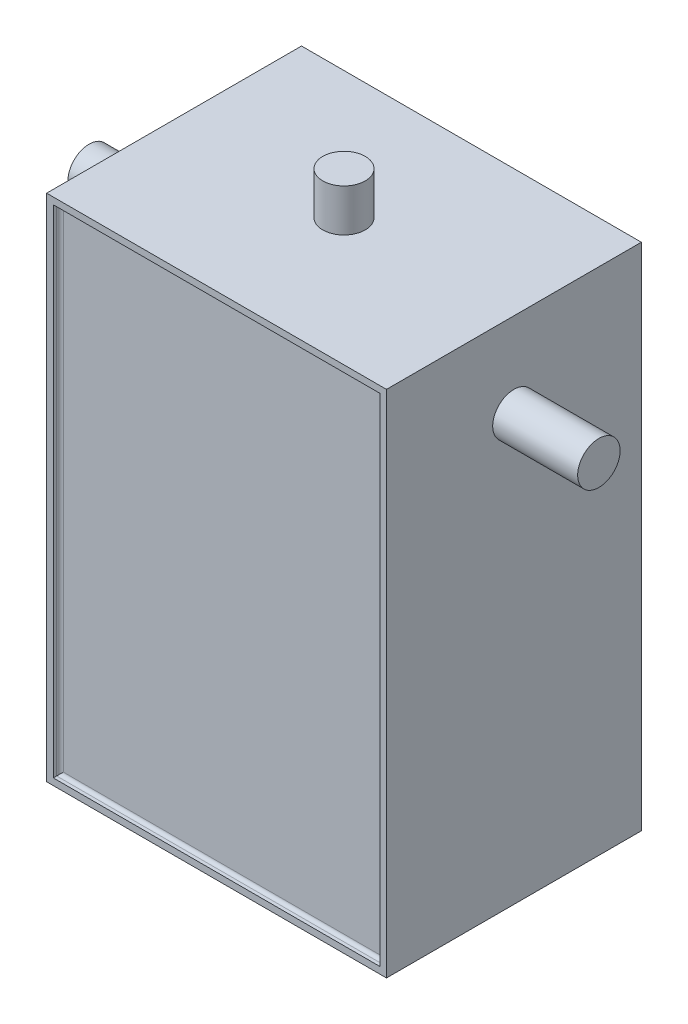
ISO-10303-21;
HEADER;
FILE_DESCRIPTION(('STEP AP214'),'2;1');
FILE_NAME('part.step','',(''),(''),'','','');
FILE_SCHEMA(('AUTOMOTIVE_DESIGN { 1 0 10303 214 1 1 1 1 }'));
ENDSEC;
DATA;
#1=APPLICATION_CONTEXT('core data for automotive mechanical design processes');
#2=APPLICATION_PROTOCOL_DEFINITION('international standard','automotive_design',2000,#1);
#3=PRODUCT_CONTEXT('',#1,'mechanical');
#4=PRODUCT('Part','Part','',(#3));
#5=PRODUCT_RELATED_PRODUCT_CATEGORY('part','',(#4));
#6=PRODUCT_DEFINITION_FORMATION('','',#4);
#7=PRODUCT_DEFINITION_CONTEXT('part definition',#1,'design');
#8=PRODUCT_DEFINITION('design','',#6,#7);
#9=PRODUCT_DEFINITION_SHAPE('','',#8);
#10=(LENGTH_UNIT() NAMED_UNIT(*) SI_UNIT(.MILLI.,.METRE.));
#11=(NAMED_UNIT(*) PLANE_ANGLE_UNIT() SI_UNIT($,.RADIAN.));
#12=(NAMED_UNIT(*) SI_UNIT($,.STERADIAN.) SOLID_ANGLE_UNIT());
#13=UNCERTAINTY_MEASURE_WITH_UNIT(LENGTH_MEASURE(1.E-05),#10,'distance_accuracy_value','');
#14=(GEOMETRIC_REPRESENTATION_CONTEXT(3) GLOBAL_UNCERTAINTY_ASSIGNED_CONTEXT((#13)) GLOBAL_UNIT_ASSIGNED_CONTEXT((#10,
#11,#12)) REPRESENTATION_CONTEXT('',''));
#15=CARTESIAN_POINT('',(0.,0.,0.));
#16=DIRECTION('',(0.,0.,1.));
#17=DIRECTION('',(1.,0.,0.));
#18=AXIS2_PLACEMENT_3D('',#15,#16,#17);
#19=CARTESIAN_POINT('',(0.,0.,-76.2));
#20=DIRECTION('',(0.,0.,-1.));
#21=DIRECTION('',(-1.,0.,0.));
#22=AXIS2_PLACEMENT_3D('',#19,#20,#21);
#23=PLANE('',#22);
#24=DIRECTION('',(0.,-1.,0.));
#25=VECTOR('',#24,1.);
#26=CARTESIAN_POINT('',(0.,0.,-76.2));
#27=LINE('',#26,#25);
#28=CARTESIAN_POINT('',(0.,152.4,-76.2));
#29=VERTEX_POINT('',#28);
#30=CARTESIAN_POINT('',(0.,0.,-76.2));
#31=VERTEX_POINT('',#30);
#32=EDGE_CURVE('E227',#29,#31,#27,.T.);
#33=ORIENTED_EDGE('',*,*,#32,.F.);
#34=DIRECTION('',(-1.,0.,0.));
#35=VECTOR('',#34,1.);
#36=CARTESIAN_POINT('',(0.,152.4,-76.2));
#37=LINE('',#36,#35);
#38=CARTESIAN_POINT('',(101.6,152.4,-76.2));
#39=VERTEX_POINT('',#38);
#40=EDGE_CURVE('E237',#39,#29,#37,.T.);
#41=ORIENTED_EDGE('',*,*,#40,.F.);
#42=DIRECTION('',(0.,1.,0.));
#43=VECTOR('',#42,1.);
#44=CARTESIAN_POINT('',(101.6,0.,-76.2));
#45=LINE('',#44,#43);
#46=CARTESIAN_POINT('',(101.6,0.,-76.2));
#47=VERTEX_POINT('',#46);
#48=EDGE_CURVE('E234',#47,#39,#45,.T.);
#49=ORIENTED_EDGE('',*,*,#48,.F.);
#50=DIRECTION('',(1.,0.,0.));
#51=VECTOR('',#50,1.);
#52=CARTESIAN_POINT('',(0.,0.,-76.2));
#53=LINE('',#52,#51);
#54=EDGE_CURVE('E230',#31,#47,#53,.T.);
#55=ORIENTED_EDGE('',*,*,#54,.F.);
#56=EDGE_LOOP('',(#33,#41,#49,#55));
#57=FACE_BOUND('',#56,.T.);
#58=DIRECTION('',(0.,1.,0.));
#59=VECTOR('',#58,1.);
#60=CARTESIAN_POINT('',(99.6,2.,-76.2));
#61=LINE('',#60,#59);
#62=CARTESIAN_POINT('',(99.6,2.,-76.2));
#63=VERTEX_POINT('',#62);
#64=CARTESIAN_POINT('',(99.6,150.4,-76.2));
#65=VERTEX_POINT('',#64);
#66=EDGE_CURVE('E167',#63,#65,#61,.T.);
#67=ORIENTED_EDGE('',*,*,#66,.T.);
#68=DIRECTION('',(-1.,0.,0.));
#69=VECTOR('',#68,1.);
#70=CARTESIAN_POINT('',(99.6,150.4,-76.2));
#71=LINE('',#70,#69);
#72=CARTESIAN_POINT('',(2.,150.4,-76.2));
#73=VERTEX_POINT('',#72);
#74=EDGE_CURVE('E172',#65,#73,#71,.T.);
#75=ORIENTED_EDGE('',*,*,#74,.T.);
#76=DIRECTION('',(0.,-1.,0.));
#77=VECTOR('',#76,1.);
#78=CARTESIAN_POINT('',(2.,150.4,-76.2));
#79=LINE('',#78,#77);
#80=CARTESIAN_POINT('',(2.,2.,-76.2));
#81=VERTEX_POINT('',#80);
#82=EDGE_CURVE('E175',#73,#81,#79,.T.);
#83=ORIENTED_EDGE('',*,*,#82,.T.);
#84=DIRECTION('',(1.,0.,0.));
#85=VECTOR('',#84,1.);
#86=CARTESIAN_POINT('',(2.,2.,-76.2));
#87=LINE('',#86,#85);
#88=EDGE_CURVE('E159',#81,#63,#87,.T.);
#89=ORIENTED_EDGE('',*,*,#88,.T.);
#90=EDGE_LOOP('',(#67,#75,#83,#89));
#91=FACE_BOUND('',#90,.T.);
#92=ADVANCED_FACE('F41',(#57,#91),#23,.T.);
#93=CARTESIAN_POINT('',(0.,0.,-76.2));
#94=DIRECTION('',(-1.,0.,0.));
#95=DIRECTION('',(0.,0.,1.));
#96=AXIS2_PLACEMENT_3D('',#93,#94,#95);
#97=PLANE('',#96);
#98=CARTESIAN_POINT('',(0.,127.,-38.1));
#99=DIRECTION('',(1.,0.,0.));
#100=DIRECTION('',(0.,1.,0.));
#101=AXIS2_PLACEMENT_3D('',#98,#99,#100);
#102=CIRCLE('',#101,6.35);
#103=CARTESIAN_POINT('',(0.,133.35,-38.1));
#104=VERTEX_POINT('',#103);
#105=EDGE_CURVE('E215',#104,#104,#102,.T.);
#106=ORIENTED_EDGE('',*,*,#105,.T.);
#107=EDGE_LOOP('',(#106));
#108=FACE_BOUND('',#107,.T.);
#109=DIRECTION('',(0.,-1.,0.));
#110=VECTOR('',#109,1.);
#111=CARTESIAN_POINT('',(0.,0.,0.));
#112=LINE('',#111,#110);
#113=CARTESIAN_POINT('',(0.,152.4,0.));
#114=VERTEX_POINT('',#113);
#115=CARTESIAN_POINT('',(0.,0.,0.));
#116=VERTEX_POINT('',#115);
#117=EDGE_CURVE('E224',#114,#116,#112,.T.);
#118=ORIENTED_EDGE('',*,*,#117,.F.);
#119=DIRECTION('',(0.,0.,1.));
#120=VECTOR('',#119,1.);
#121=CARTESIAN_POINT('',(0.,152.4,-76.2));
#122=LINE('',#121,#120);
#123=EDGE_CURVE('E214',#29,#114,#122,.T.);
#124=ORIENTED_EDGE('',*,*,#123,.F.);
#125=ORIENTED_EDGE('',*,*,#32,.T.);
#126=DIRECTION('',(0.,0.,1.));
#127=VECTOR('',#126,1.);
#128=CARTESIAN_POINT('',(0.,0.,-76.2));
#129=LINE('',#128,#127);
#130=EDGE_CURVE('E240',#31,#116,#129,.T.);
#131=ORIENTED_EDGE('',*,*,#130,.T.);
#132=EDGE_LOOP('',(#118,#124,#125,#131));
#133=FACE_BOUND('',#132,.T.);
#134=ADVANCED_FACE('F329',(#108,#133),#97,.T.);
#135=CARTESIAN_POINT('',(0.,152.4,-76.2));
#136=DIRECTION('',(0.,1.,0.));
#137=DIRECTION('',(0.,0.,1.));
#138=AXIS2_PLACEMENT_3D('',#135,#136,#137);
#139=PLANE('',#138);
#140=CARTESIAN_POINT('',(50.8,152.4,-38.1));
#141=DIRECTION('',(0.,1.,0.));
#142=DIRECTION('',(0.,0.,1.));
#143=AXIS2_PLACEMENT_3D('',#140,#141,#142);
#144=CIRCLE('',#143,6.35);
#145=CARTESIAN_POINT('',(50.8,152.4,-31.75));
#146=VERTEX_POINT('',#145);
#147=EDGE_CURVE('E310',#146,#146,#144,.T.);
#148=ORIENTED_EDGE('',*,*,#147,.F.);
#149=EDGE_LOOP('',(#148));
#150=FACE_BOUND('',#149,.T.);
#151=DIRECTION('',(-1.,0.,0.));
#152=VECTOR('',#151,1.);
#153=CARTESIAN_POINT('',(0.,152.4,0.));
#154=LINE('',#153,#152);
#155=CARTESIAN_POINT('',(101.6,152.4,0.));
#156=VERTEX_POINT('',#155);
#157=EDGE_CURVE('E231',#156,#114,#154,.T.);
#158=ORIENTED_EDGE('',*,*,#157,.F.);
#159=DIRECTION('',(0.,0.,1.));
#160=VECTOR('',#159,1.);
#161=CARTESIAN_POINT('',(101.6,152.4,-76.2));
#162=LINE('',#161,#160);
#163=EDGE_CURVE('E252',#39,#156,#162,.T.);
#164=ORIENTED_EDGE('',*,*,#163,.F.);
#165=ORIENTED_EDGE('',*,*,#40,.T.);
#166=ORIENTED_EDGE('',*,*,#123,.T.);
#167=EDGE_LOOP('',(#158,#164,#165,#166));
#168=FACE_BOUND('',#167,.T.);
#169=ADVANCED_FACE('F325',(#150,#168),#139,.T.);
#170=CARTESIAN_POINT('',(101.6,0.,-76.2));
#171=DIRECTION('',(1.,0.,0.));
#172=DIRECTION('',(0.,1.,0.));
#173=AXIS2_PLACEMENT_3D('',#170,#171,#172);
#174=PLANE('',#173);
#175=CARTESIAN_POINT('',(101.6,127.,-38.1));
#176=DIRECTION('',(1.,0.,0.));
#177=DIRECTION('',(0.,1.,0.));
#178=AXIS2_PLACEMENT_3D('',#175,#176,#177);
#179=CIRCLE('',#178,6.35);
#180=CARTESIAN_POINT('',(101.6,133.35,-38.1));
#181=VERTEX_POINT('',#180);
#182=EDGE_CURVE('E218',#181,#181,#179,.T.);
#183=ORIENTED_EDGE('',*,*,#182,.F.);
#184=EDGE_LOOP('',(#183));
#185=FACE_BOUND('',#184,.T.);
#186=DIRECTION('',(0.,1.,0.));
#187=VECTOR('',#186,1.);
#188=CARTESIAN_POINT('',(101.6,0.,0.));
#189=LINE('',#188,#187);
#190=CARTESIAN_POINT('',(101.6,0.,0.));
#191=VERTEX_POINT('',#190);
#192=EDGE_CURVE('E246',#191,#156,#189,.T.);
#193=ORIENTED_EDGE('',*,*,#192,.F.);
#194=DIRECTION('',(0.,0.,1.));
#195=VECTOR('',#194,1.);
#196=CARTESIAN_POINT('',(101.6,0.,-76.2));
#197=LINE('',#196,#195);
#198=EDGE_CURVE('E254',#47,#191,#197,.T.);
#199=ORIENTED_EDGE('',*,*,#198,.F.);
#200=ORIENTED_EDGE('',*,*,#48,.T.);
#201=ORIENTED_EDGE('',*,*,#163,.T.);
#202=EDGE_LOOP('',(#193,#199,#200,#201));
#203=FACE_BOUND('',#202,.T.);
#204=ADVANCED_FACE('F328',(#185,#203),#174,.T.);
#205=CARTESIAN_POINT('',(0.,0.,-76.2));
#206=DIRECTION('',(0.,-1.,0.));
#207=DIRECTION('',(0.,0.,-1.));
#208=AXIS2_PLACEMENT_3D('',#205,#206,#207);
#209=PLANE('',#208);
#210=CARTESIAN_POINT('',(50.8,0.,-38.1));
#211=DIRECTION('',(0.,-1.,0.));
#212=DIRECTION('',(0.,0.,-1.));
#213=AXIS2_PLACEMENT_3D('',#210,#211,#212);
#214=CIRCLE('',#213,12.7);
#215=CARTESIAN_POINT('',(50.8,0.,-50.8));
#216=VERTEX_POINT('',#215);
#217=EDGE_CURVE('E210',#216,#216,#214,.T.);
#218=ORIENTED_EDGE('',*,*,#217,.F.);
#219=EDGE_LOOP('',(#218));
#220=FACE_BOUND('',#219,.T.);
#221=DIRECTION('',(1.,0.,0.));
#222=VECTOR('',#221,1.);
#223=CARTESIAN_POINT('',(0.,0.,0.));
#224=LINE('',#223,#222);
#225=EDGE_CURVE('E243',#116,#191,#224,.T.);
#226=ORIENTED_EDGE('',*,*,#225,.F.);
#227=ORIENTED_EDGE('',*,*,#130,.F.);
#228=ORIENTED_EDGE('',*,*,#54,.T.);
#229=ORIENTED_EDGE('',*,*,#198,.T.);
#230=EDGE_LOOP('',(#226,#227,#228,#229));
#231=FACE_BOUND('',#230,.T.);
#232=ADVANCED_FACE('F345',(#220,#231),#209,.T.);
#233=CARTESIAN_POINT('',(0.,0.,0.));
#234=DIRECTION('',(0.,0.,-1.));
#235=DIRECTION('',(-1.,0.,0.));
#236=AXIS2_PLACEMENT_3D('',#233,#234,#235);
#237=PLANE('',#236);
#238=DIRECTION('',(0.,-1.,0.));
#239=VECTOR('',#238,1.);
#240=CARTESIAN_POINT('',(2.,150.4,0.));
#241=LINE('',#240,#239);
#242=CARTESIAN_POINT('',(2.,150.4,0.));
#243=VERTEX_POINT('',#242);
#244=CARTESIAN_POINT('',(2.,2.,0.));
#245=VERTEX_POINT('',#244);
#246=EDGE_CURVE('E188',#243,#245,#241,.T.);
#247=ORIENTED_EDGE('',*,*,#246,.F.);
#248=DIRECTION('',(-1.,0.,0.));
#249=VECTOR('',#248,1.);
#250=CARTESIAN_POINT('',(99.6,150.4,0.));
#251=LINE('',#250,#249);
#252=CARTESIAN_POINT('',(99.6,150.4,0.));
#253=VERTEX_POINT('',#252);
#254=EDGE_CURVE('E185',#253,#243,#251,.T.);
#255=ORIENTED_EDGE('',*,*,#254,.F.);
#256=DIRECTION('',(0.,1.,0.));
#257=VECTOR('',#256,1.);
#258=CARTESIAN_POINT('',(99.6,2.,0.));
#259=LINE('',#258,#257);
#260=CARTESIAN_POINT('',(99.6,2.,0.));
#261=VERTEX_POINT('',#260);
#262=EDGE_CURVE('E195',#261,#253,#259,.T.);
#263=ORIENTED_EDGE('',*,*,#262,.F.);
#264=DIRECTION('',(1.,0.,0.));
#265=VECTOR('',#264,1.);
#266=CARTESIAN_POINT('',(2.,2.,0.));
#267=LINE('',#266,#265);
#268=EDGE_CURVE('E192',#245,#261,#267,.T.);
#269=ORIENTED_EDGE('',*,*,#268,.F.);
#270=EDGE_LOOP('',(#247,#255,#263,#269));
#271=FACE_BOUND('',#270,.T.);
#272=ORIENTED_EDGE('',*,*,#117,.T.);
#273=ORIENTED_EDGE('',*,*,#225,.T.);
#274=ORIENTED_EDGE('',*,*,#192,.T.);
#275=ORIENTED_EDGE('',*,*,#157,.T.);
#276=EDGE_LOOP('',(#272,#273,#274,#275));
#277=FACE_BOUND('',#276,.T.);
#278=ADVANCED_FACE('F334',(#271,#277),#237,.F.);
#279=CARTESIAN_POINT('',(127.,127.,-38.1));
#280=DIRECTION('',(-1.,0.,0.));
#281=DIRECTION('',(0.,-1.,0.));
#282=AXIS2_PLACEMENT_3D('',#279,#280,#281);
#283=CYLINDRICAL_SURFACE('',#282,6.35);
#284=CARTESIAN_POINT('',(127.,127.,-38.1));
#285=DIRECTION('',(1.,0.,0.));
#286=DIRECTION('',(0.,1.,0.));
#287=AXIS2_PLACEMENT_3D('',#284,#285,#286);
#288=CIRCLE('',#287,6.35);
#289=CARTESIAN_POINT('',(127.,133.35,-38.1));
#290=VERTEX_POINT('',#289);
#291=EDGE_CURVE('E221',#290,#290,#288,.T.);
#292=ORIENTED_EDGE('',*,*,#291,.F.);
#293=EDGE_LOOP('',(#292));
#294=FACE_BOUND('',#293,.T.);
#295=ORIENTED_EDGE('',*,*,#182,.T.);
#296=EDGE_LOOP('',(#295));
#297=FACE_BOUND('',#296,.T.);
#298=ADVANCED_FACE('F353',(#294,#297),#283,.T.);
#299=CARTESIAN_POINT('',(127.,127.,-38.1));
#300=DIRECTION('',(1.,0.,0.));
#301=DIRECTION('',(0.,1.,0.));
#302=AXIS2_PLACEMENT_3D('',#299,#300,#301);
#303=PLANE('',#302);
#304=ORIENTED_EDGE('',*,*,#291,.T.);
#305=EDGE_LOOP('',(#304));
#306=FACE_BOUND('',#305,.T.);
#307=ADVANCED_FACE('F369',(#306),#303,.T.);
#308=CARTESIAN_POINT('',(0.,127.,-38.1));
#309=DIRECTION('',(-1.,0.,0.));
#310=DIRECTION('',(0.,-1.,0.));
#311=AXIS2_PLACEMENT_3D('',#308,#309,#310);
#312=CYLINDRICAL_SURFACE('',#311,6.35);
#313=ORIENTED_EDGE('',*,*,#105,.F.);
#314=EDGE_LOOP('',(#313));
#315=FACE_BOUND('',#314,.T.);
#316=CARTESIAN_POINT('',(-25.4,127.,-38.1));
#317=DIRECTION('',(1.,0.,0.));
#318=DIRECTION('',(0.,1.,0.));
#319=AXIS2_PLACEMENT_3D('',#316,#317,#318);
#320=CIRCLE('',#319,6.35);
#321=CARTESIAN_POINT('',(-25.4,133.35,-38.1));
#322=VERTEX_POINT('',#321);
#323=EDGE_CURVE('E209',#322,#322,#320,.T.);
#324=ORIENTED_EDGE('',*,*,#323,.T.);
#325=EDGE_LOOP('',(#324));
#326=FACE_BOUND('',#325,.T.);
#327=ADVANCED_FACE('F373',(#315,#326),#312,.T.);
#328=CARTESIAN_POINT('',(-25.4,127.,-38.1));
#329=DIRECTION('',(1.,0.,0.));
#330=DIRECTION('',(0.,1.,0.));
#331=AXIS2_PLACEMENT_3D('',#328,#329,#330);
#332=PLANE('',#331);
#333=ORIENTED_EDGE('',*,*,#323,.F.);
#334=EDGE_LOOP('',(#333));
#335=FACE_BOUND('',#334,.T.);
#336=ADVANCED_FACE('F377',(#335),#332,.F.);
#337=CARTESIAN_POINT('',(50.8,-12.7,-38.1));
#338=DIRECTION('',(0.,1.,0.));
#339=DIRECTION('',(0.,0.,1.));
#340=AXIS2_PLACEMENT_3D('',#337,#338,#339);
#341=CYLINDRICAL_SURFACE('',#340,12.7);
#342=CARTESIAN_POINT('',(50.8,-12.7,-38.1));
#343=DIRECTION('',(0.,-1.,0.));
#344=DIRECTION('',(0.,0.,-1.));
#345=AXIS2_PLACEMENT_3D('',#342,#343,#344);
#346=CIRCLE('',#345,12.7);
#347=CARTESIAN_POINT('',(50.8,-12.7,-50.8));
#348=VERTEX_POINT('',#347);
#349=EDGE_CURVE('E201',#348,#348,#346,.T.);
#350=ORIENTED_EDGE('',*,*,#349,.F.);
#351=EDGE_LOOP('',(#350));
#352=FACE_BOUND('',#351,.T.);
#353=ORIENTED_EDGE('',*,*,#217,.T.);
#354=EDGE_LOOP('',(#353));
#355=FACE_BOUND('',#354,.T.);
#356=ADVANCED_FACE('F381',(#352,#355),#341,.T.);
#357=CARTESIAN_POINT('',(50.8,-12.7,-38.1));
#358=DIRECTION('',(0.,-1.,0.));
#359=DIRECTION('',(0.,0.,-1.));
#360=AXIS2_PLACEMENT_3D('',#357,#358,#359);
#361=PLANE('',#360);
#362=ORIENTED_EDGE('',*,*,#349,.T.);
#363=EDGE_LOOP('',(#362));
#364=FACE_BOUND('',#363,.T.);
#365=ADVANCED_FACE('F385',(#364),#361,.T.);
#366=CARTESIAN_POINT('',(99.6,150.4,-2.));
#367=DIRECTION('',(0.,1.,0.));
#368=DIRECTION('',(0.,0.,1.));
#369=AXIS2_PLACEMENT_3D('',#366,#367,#368);
#370=PLANE('',#369);
#371=DIRECTION('',(0.,0.,1.));
#372=VECTOR('',#371,1.);
#373=CARTESIAN_POINT('',(2.,150.4,-2.));
#374=LINE('',#373,#372);
#375=CARTESIAN_POINT('',(2.,150.4,-1.));
#376=VERTEX_POINT('',#375);
#377=EDGE_CURVE('E198',#376,#243,#374,.T.);
#378=ORIENTED_EDGE('',*,*,#377,.F.);
#379=DIRECTION('',(-1.,0.,0.));
#380=VECTOR('',#379,1.);
#381=CARTESIAN_POINT('',(99.6,150.4,-1.));
#382=LINE('',#381,#380);
#383=CARTESIAN_POINT('',(99.6,150.4,-1.));
#384=VERTEX_POINT('',#383);
#385=EDGE_CURVE('E272',#376,#384,#382,.F.);
#386=ORIENTED_EDGE('',*,*,#385,.T.);
#387=DIRECTION('',(0.,0.,1.));
#388=VECTOR('',#387,1.);
#389=CARTESIAN_POINT('',(99.6,150.4,-2.));
#390=LINE('',#389,#388);
#391=EDGE_CURVE('E199',#384,#253,#390,.T.);
#392=ORIENTED_EDGE('',*,*,#391,.T.);
#393=ORIENTED_EDGE('',*,*,#254,.T.);
#394=EDGE_LOOP('',(#378,#386,#392,#393));
#395=FACE_BOUND('',#394,.T.);
#396=ADVANCED_FACE('F389',(#395),#370,.F.);
#397=CARTESIAN_POINT('',(99.6,2.,-2.));
#398=DIRECTION('',(1.,0.,0.));
#399=DIRECTION('',(0.,1.,0.));
#400=AXIS2_PLACEMENT_3D('',#397,#398,#399);
#401=PLANE('',#400);
#402=ORIENTED_EDGE('',*,*,#391,.F.);
#403=DIRECTION('',(0.,1.,0.));
#404=VECTOR('',#403,1.);
#405=CARTESIAN_POINT('',(99.6,2.,-1.));
#406=LINE('',#405,#404);
#407=CARTESIAN_POINT('',(99.6,2.,-1.));
#408=VERTEX_POINT('',#407);
#409=EDGE_CURVE('E270',#384,#408,#406,.F.);
#410=ORIENTED_EDGE('',*,*,#409,.T.);
#411=DIRECTION('',(0.,0.,1.));
#412=VECTOR('',#411,1.);
#413=CARTESIAN_POINT('',(99.6,2.,-2.));
#414=LINE('',#413,#412);
#415=EDGE_CURVE('E202',#408,#261,#414,.T.);
#416=ORIENTED_EDGE('',*,*,#415,.T.);
#417=ORIENTED_EDGE('',*,*,#262,.T.);
#418=EDGE_LOOP('',(#402,#410,#416,#417));
#419=FACE_BOUND('',#418,.T.);
#420=ADVANCED_FACE('F393',(#419),#401,.F.);
#421=CARTESIAN_POINT('',(2.,2.,-2.));
#422=DIRECTION('',(0.,-1.,0.));
#423=DIRECTION('',(0.,0.,-1.));
#424=AXIS2_PLACEMENT_3D('',#421,#422,#423);
#425=PLANE('',#424);
#426=ORIENTED_EDGE('',*,*,#415,.F.);
#427=DIRECTION('',(1.,0.,0.));
#428=VECTOR('',#427,1.);
#429=CARTESIAN_POINT('',(2.,2.,-1.));
#430=LINE('',#429,#428);
#431=CARTESIAN_POINT('',(2.,2.,-1.));
#432=VERTEX_POINT('',#431);
#433=EDGE_CURVE('E265',#408,#432,#430,.F.);
#434=ORIENTED_EDGE('',*,*,#433,.T.);
#435=DIRECTION('',(0.,0.,1.));
#436=VECTOR('',#435,1.);
#437=CARTESIAN_POINT('',(2.,2.,-2.));
#438=LINE('',#437,#436);
#439=EDGE_CURVE('E204',#432,#245,#438,.T.);
#440=ORIENTED_EDGE('',*,*,#439,.T.);
#441=ORIENTED_EDGE('',*,*,#268,.T.);
#442=EDGE_LOOP('',(#426,#434,#440,#441));
#443=FACE_BOUND('',#442,.T.);
#444=ADVANCED_FACE('F399',(#443),#425,.F.);
#445=CARTESIAN_POINT('',(2.,150.4,-2.));
#446=DIRECTION('',(-1.,0.,0.));
#447=DIRECTION('',(0.,0.,1.));
#448=AXIS2_PLACEMENT_3D('',#445,#446,#447);
#449=PLANE('',#448);
#450=ORIENTED_EDGE('',*,*,#439,.F.);
#451=DIRECTION('',(0.,-1.,0.));
#452=VECTOR('',#451,1.);
#453=CARTESIAN_POINT('',(2.,150.4,-1.));
#454=LINE('',#453,#452);
#455=EDGE_CURVE('E268',#432,#376,#454,.F.);
#456=ORIENTED_EDGE('',*,*,#455,.T.);
#457=ORIENTED_EDGE('',*,*,#377,.T.);
#458=ORIENTED_EDGE('',*,*,#246,.T.);
#459=EDGE_LOOP('',(#450,#456,#457,#458));
#460=FACE_BOUND('',#459,.T.);
#461=ADVANCED_FACE('F395',(#460),#449,.F.);
#462=CARTESIAN_POINT('',(0.,0.,-2.));
#463=DIRECTION('',(0.,0.,1.));
#464=DIRECTION('',(1.,0.,0.));
#465=AXIS2_PLACEMENT_3D('',#462,#463,#464);
#466=PLANE('',#465);
#467=DIRECTION('',(0.,-1.,0.));
#468=VECTOR('',#467,1.);
#469=CARTESIAN_POINT('',(3.,0.,-2.));
#470=LINE('',#469,#468);
#471=CARTESIAN_POINT('',(3.,149.4,-2.));
#472=VERTEX_POINT('',#471);
#473=CARTESIAN_POINT('',(3.,3.,-2.));
#474=VERTEX_POINT('',#473);
#475=EDGE_CURVE('E260',#472,#474,#470,.T.);
#476=ORIENTED_EDGE('',*,*,#475,.T.);
#477=DIRECTION('',(1.,0.,0.));
#478=VECTOR('',#477,1.);
#479=CARTESIAN_POINT('',(0.,3.,-2.));
#480=LINE('',#479,#478);
#481=CARTESIAN_POINT('',(98.6,3.,-2.));
#482=VERTEX_POINT('',#481);
#483=EDGE_CURVE('E262',#474,#482,#480,.T.);
#484=ORIENTED_EDGE('',*,*,#483,.T.);
#485=DIRECTION('',(0.,1.,0.));
#486=VECTOR('',#485,1.);
#487=CARTESIAN_POINT('',(98.6,0.,-2.));
#488=LINE('',#487,#486);
#489=CARTESIAN_POINT('',(98.6,149.4,-2.));
#490=VERTEX_POINT('',#489);
#491=EDGE_CURVE('E258',#482,#490,#488,.T.);
#492=ORIENTED_EDGE('',*,*,#491,.T.);
#493=DIRECTION('',(-1.,0.,0.));
#494=VECTOR('',#493,1.);
#495=CARTESIAN_POINT('',(0.,149.4,-2.));
#496=LINE('',#495,#494);
#497=EDGE_CURVE('E213',#490,#472,#496,.T.);
#498=ORIENTED_EDGE('',*,*,#497,.T.);
#499=EDGE_LOOP('',(#476,#484,#492,#498));
#500=FACE_BOUND('',#499,.T.);
#501=ADVANCED_FACE('F398',(#500),#466,.T.);
#502=CARTESIAN_POINT('',(0.,149.4,-1.));
#503=DIRECTION('',(-1.,0.,0.));
#504=DIRECTION('',(0.,0.,1.));
#505=AXIS2_PLACEMENT_3D('',#502,#503,#504);
#506=CYLINDRICAL_SURFACE('',#505,1.);
#507=CARTESIAN_POINT('',(98.6,149.4,-1.));
#508=DIRECTION('',(-0.707106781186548,0.707106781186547,0.));
#509=DIRECTION('',(0.707106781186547,0.707106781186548,0.));
#510=AXIS2_PLACEMENT_3D('',#507,#508,#509);
#511=ELLIPSE('',#510,1.41421356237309,1.);
#512=EDGE_CURVE('E277',#384,#490,#511,.T.);
#513=ORIENTED_EDGE('',*,*,#512,.F.);
#514=ORIENTED_EDGE('',*,*,#385,.F.);
#515=CARTESIAN_POINT('',(3.,149.4,-1.));
#516=DIRECTION('',(-0.707106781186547,-0.707106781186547,0.));
#517=DIRECTION('',(0.707106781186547,-0.707106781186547,0.));
#518=AXIS2_PLACEMENT_3D('',#515,#516,#517);
#519=ELLIPSE('',#518,1.41421356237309,1.);
#520=EDGE_CURVE('E189',#472,#376,#519,.F.);
#521=ORIENTED_EDGE('',*,*,#520,.F.);
#522=ORIENTED_EDGE('',*,*,#497,.F.);
#523=EDGE_LOOP('',(#513,#514,#521,#522));
#524=FACE_BOUND('',#523,.T.);
#525=ADVANCED_FACE('F409',(#524),#506,.F.);
#526=CARTESIAN_POINT('',(3.,0.,-1.));
#527=DIRECTION('',(0.,-1.,0.));
#528=DIRECTION('',(0.,0.,-1.));
#529=AXIS2_PLACEMENT_3D('',#526,#527,#528);
#530=CYLINDRICAL_SURFACE('',#529,1.);
#531=ORIENTED_EDGE('',*,*,#520,.T.);
#532=ORIENTED_EDGE('',*,*,#455,.F.);
#533=CARTESIAN_POINT('',(3.,3.,-1.));
#534=DIRECTION('',(0.707106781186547,-0.707106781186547,0.));
#535=DIRECTION('',(0.707106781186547,0.707106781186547,0.));
#536=AXIS2_PLACEMENT_3D('',#533,#534,#535);
#537=ELLIPSE('',#536,1.41421356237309,1.);
#538=EDGE_CURVE('E275',#474,#432,#537,.F.);
#539=ORIENTED_EDGE('',*,*,#538,.F.);
#540=ORIENTED_EDGE('',*,*,#475,.F.);
#541=EDGE_LOOP('',(#531,#532,#539,#540));
#542=FACE_BOUND('',#541,.T.);
#543=ADVANCED_FACE('F494',(#542),#530,.F.);
#544=CARTESIAN_POINT('',(98.6,0.,-1.));
#545=DIRECTION('',(0.,1.,0.));
#546=DIRECTION('',(-1.,0.,0.));
#547=AXIS2_PLACEMENT_3D('',#544,#545,#546);
#548=CYLINDRICAL_SURFACE('',#547,1.);
#549=ORIENTED_EDGE('',*,*,#512,.T.);
#550=ORIENTED_EDGE('',*,*,#491,.F.);
#551=CARTESIAN_POINT('',(98.6,3.,-1.));
#552=DIRECTION('',(0.707106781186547,0.707106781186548,0.));
#553=DIRECTION('',(0.707106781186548,-0.707106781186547,0.));
#554=AXIS2_PLACEMENT_3D('',#551,#552,#553);
#555=ELLIPSE('',#554,1.4142135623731,1.);
#556=EDGE_CURVE('E182',#408,#482,#555,.T.);
#557=ORIENTED_EDGE('',*,*,#556,.F.);
#558=ORIENTED_EDGE('',*,*,#409,.F.);
#559=EDGE_LOOP('',(#549,#550,#557,#558));
#560=FACE_BOUND('',#559,.T.);
#561=ADVANCED_FACE('F486',(#560),#548,.F.);
#562=CARTESIAN_POINT('',(0.,3.,-1.));
#563=DIRECTION('',(1.,0.,0.));
#564=DIRECTION('',(0.,0.,-1.));
#565=AXIS2_PLACEMENT_3D('',#562,#563,#564);
#566=CYLINDRICAL_SURFACE('',#565,1.);
#567=ORIENTED_EDGE('',*,*,#538,.T.);
#568=ORIENTED_EDGE('',*,*,#433,.F.);
#569=ORIENTED_EDGE('',*,*,#556,.T.);
#570=ORIENTED_EDGE('',*,*,#483,.F.);
#571=EDGE_LOOP('',(#567,#568,#569,#570));
#572=FACE_BOUND('',#571,.T.);
#573=ADVANCED_FACE('F415',(#572),#566,.F.);
#574=CARTESIAN_POINT('',(99.6,150.4,-74.2));
#575=DIRECTION('',(0.,-1.,0.));
#576=DIRECTION('',(0.,0.,-1.));
#577=AXIS2_PLACEMENT_3D('',#574,#575,#576);
#578=PLANE('',#577);
#579=DIRECTION('',(0.,0.,-1.));
#580=VECTOR('',#579,1.);
#581=CARTESIAN_POINT('',(99.6,150.4,-74.2));
#582=LINE('',#581,#580);
#583=CARTESIAN_POINT('',(99.6,150.4,-75.2));
#584=VERTEX_POINT('',#583);
#585=EDGE_CURVE('E164',#584,#65,#582,.T.);
#586=ORIENTED_EDGE('',*,*,#585,.F.);
#587=DIRECTION('',(-1.,0.,0.));
#588=VECTOR('',#587,1.);
#589=CARTESIAN_POINT('',(2.,150.4,-75.2));
#590=LINE('',#589,#588);
#591=CARTESIAN_POINT('',(2.,150.4,-75.2));
#592=VERTEX_POINT('',#591);
#593=EDGE_CURVE('E11',#584,#592,#590,.T.);
#594=ORIENTED_EDGE('',*,*,#593,.T.);
#595=DIRECTION('',(0.,0.,-1.));
#596=VECTOR('',#595,1.);
#597=CARTESIAN_POINT('',(2.,150.4,-74.2));
#598=LINE('',#597,#596);
#599=EDGE_CURVE('E180',#592,#73,#598,.T.);
#600=ORIENTED_EDGE('',*,*,#599,.T.);
#601=ORIENTED_EDGE('',*,*,#74,.F.);
#602=EDGE_LOOP('',(#586,#594,#600,#601));
#603=FACE_BOUND('',#602,.T.);
#604=ADVANCED_FACE('F411',(#603),#578,.T.);
#605=CARTESIAN_POINT('',(2.,150.4,-74.2));
#606=DIRECTION('',(1.,0.,0.));
#607=DIRECTION('',(0.,0.,-1.));
#608=AXIS2_PLACEMENT_3D('',#605,#606,#607);
#609=PLANE('',#608);
#610=ORIENTED_EDGE('',*,*,#599,.F.);
#611=DIRECTION('',(0.,-1.,0.));
#612=VECTOR('',#611,1.);
#613=CARTESIAN_POINT('',(2.,2.,-75.2));
#614=LINE('',#613,#612);
#615=CARTESIAN_POINT('',(2.,2.,-75.2));
#616=VERTEX_POINT('',#615);
#617=EDGE_CURVE('E292',#592,#616,#614,.T.);
#618=ORIENTED_EDGE('',*,*,#617,.T.);
#619=DIRECTION('',(0.,0.,-1.));
#620=VECTOR('',#619,1.);
#621=CARTESIAN_POINT('',(2.,2.,-74.2));
#622=LINE('',#621,#620);
#623=EDGE_CURVE('E163',#616,#81,#622,.T.);
#624=ORIENTED_EDGE('',*,*,#623,.T.);
#625=ORIENTED_EDGE('',*,*,#82,.F.);
#626=EDGE_LOOP('',(#610,#618,#624,#625));
#627=FACE_BOUND('',#626,.T.);
#628=ADVANCED_FACE('F414',(#627),#609,.T.);
#629=CARTESIAN_POINT('',(2.,2.,-74.2));
#630=DIRECTION('',(0.,1.,0.));
#631=DIRECTION('',(0.,0.,1.));
#632=AXIS2_PLACEMENT_3D('',#629,#630,#631);
#633=PLANE('',#632);
#634=ORIENTED_EDGE('',*,*,#623,.F.);
#635=DIRECTION('',(1.,0.,0.));
#636=VECTOR('',#635,1.);
#637=CARTESIAN_POINT('',(99.6,2.,-75.2));
#638=LINE('',#637,#636);
#639=CARTESIAN_POINT('',(99.6,2.,-75.2));
#640=VERTEX_POINT('',#639);
#641=EDGE_CURVE('E162',#616,#640,#638,.T.);
#642=ORIENTED_EDGE('',*,*,#641,.T.);
#643=DIRECTION('',(0.,0.,-1.));
#644=VECTOR('',#643,1.);
#645=CARTESIAN_POINT('',(99.6,2.,-74.2));
#646=LINE('',#645,#644);
#647=EDGE_CURVE('E154',#640,#63,#646,.T.);
#648=ORIENTED_EDGE('',*,*,#647,.T.);
#649=ORIENTED_EDGE('',*,*,#88,.F.);
#650=EDGE_LOOP('',(#634,#642,#648,#649));
#651=FACE_BOUND('',#650,.T.);
#652=ADVANCED_FACE('F157',(#651),#633,.T.);
#653=CARTESIAN_POINT('',(99.6,2.,-74.2));
#654=DIRECTION('',(-1.,0.,0.));
#655=DIRECTION('',(0.,-1.,0.));
#656=AXIS2_PLACEMENT_3D('',#653,#654,#655);
#657=PLANE('',#656);
#658=ORIENTED_EDGE('',*,*,#647,.F.);
#659=DIRECTION('',(0.,1.,0.));
#660=VECTOR('',#659,1.);
#661=CARTESIAN_POINT('',(99.6,150.4,-75.2));
#662=LINE('',#661,#660);
#663=EDGE_CURVE('E50',#640,#584,#662,.T.);
#664=ORIENTED_EDGE('',*,*,#663,.T.);
#665=ORIENTED_EDGE('',*,*,#585,.T.);
#666=ORIENTED_EDGE('',*,*,#66,.F.);
#667=EDGE_LOOP('',(#658,#664,#665,#666));
#668=FACE_BOUND('',#667,.T.);
#669=ADVANCED_FACE('F168',(#668),#657,.T.);
#670=CARTESIAN_POINT('',(0.,0.,-74.2));
#671=DIRECTION('',(0.,0.,-1.));
#672=DIRECTION('',(1.,0.,0.));
#673=AXIS2_PLACEMENT_3D('',#670,#671,#672);
#674=PLANE('',#673);
#675=DIRECTION('',(0.,1.,0.));
#676=VECTOR('',#675,1.);
#677=CARTESIAN_POINT('',(98.6,2.,-74.2));
#678=LINE('',#677,#676);
#679=CARTESIAN_POINT('',(98.6,149.4,-74.2));
#680=VERTEX_POINT('',#679);
#681=CARTESIAN_POINT('',(98.6,3.,-74.2));
#682=VERTEX_POINT('',#681);
#683=EDGE_CURVE('E285',#680,#682,#678,.F.);
#684=ORIENTED_EDGE('',*,*,#683,.T.);
#685=DIRECTION('',(1.,0.,0.));
#686=VECTOR('',#685,1.);
#687=CARTESIAN_POINT('',(2.,3.,-74.2));
#688=LINE('',#687,#686);
#689=CARTESIAN_POINT('',(3.,3.,-74.2));
#690=VERTEX_POINT('',#689);
#691=EDGE_CURVE('E289',#682,#690,#688,.F.);
#692=ORIENTED_EDGE('',*,*,#691,.T.);
#693=DIRECTION('',(0.,-1.,0.));
#694=VECTOR('',#693,1.);
#695=CARTESIAN_POINT('',(3.,150.4,-74.2));
#696=LINE('',#695,#694);
#697=CARTESIAN_POINT('',(3.,149.4,-74.2));
#698=VERTEX_POINT('',#697);
#699=EDGE_CURVE('E287',#690,#698,#696,.F.);
#700=ORIENTED_EDGE('',*,*,#699,.T.);
#701=DIRECTION('',(-1.,0.,0.));
#702=VECTOR('',#701,1.);
#703=CARTESIAN_POINT('',(99.6,149.4,-74.2));
#704=LINE('',#703,#702);
#705=EDGE_CURVE('E283',#698,#680,#704,.F.);
#706=ORIENTED_EDGE('',*,*,#705,.T.);
#707=EDGE_LOOP('',(#684,#692,#700,#706));
#708=FACE_BOUND('',#707,.T.);
#709=ADVANCED_FACE('F418',(#708),#674,.T.);
#710=CARTESIAN_POINT('',(99.6,149.4,-75.2));
#711=DIRECTION('',(1.,0.,0.));
#712=DIRECTION('',(0.,0.,-1.));
#713=AXIS2_PLACEMENT_3D('',#710,#711,#712);
#714=CYLINDRICAL_SURFACE('',#713,1.);
#715=CARTESIAN_POINT('',(98.6,149.4,-75.2));
#716=DIRECTION('',(0.707106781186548,-0.707106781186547,0.));
#717=DIRECTION('',(-0.707106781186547,-0.707106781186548,0.));
#718=AXIS2_PLACEMENT_3D('',#715,#716,#717);
#719=ELLIPSE('',#718,1.41421356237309,1.);
#720=EDGE_CURVE('E299',#680,#584,#719,.F.);
#721=ORIENTED_EDGE('',*,*,#720,.F.);
#722=ORIENTED_EDGE('',*,*,#705,.F.);
#723=CARTESIAN_POINT('',(3.,149.4,-75.2));
#724=DIRECTION('',(0.707106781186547,0.707106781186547,0.));
#725=DIRECTION('',(-0.707106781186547,0.707106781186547,0.));
#726=AXIS2_PLACEMENT_3D('',#723,#724,#725);
#727=ELLIPSE('',#726,1.41421356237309,1.);
#728=EDGE_CURVE('E45',#592,#698,#727,.T.);
#729=ORIENTED_EDGE('',*,*,#728,.F.);
#730=ORIENTED_EDGE('',*,*,#593,.F.);
#731=EDGE_LOOP('',(#721,#722,#729,#730));
#732=FACE_BOUND('',#731,.T.);
#733=ADVANCED_FACE('F43',(#732),#714,.F.);
#734=CARTESIAN_POINT('',(3.,150.4,-75.2));
#735=DIRECTION('',(0.,1.,0.));
#736=DIRECTION('',(0.,0.,1.));
#737=AXIS2_PLACEMENT_3D('',#734,#735,#736);
#738=CYLINDRICAL_SURFACE('',#737,1.);
#739=ORIENTED_EDGE('',*,*,#728,.T.);
#740=ORIENTED_EDGE('',*,*,#699,.F.);
#741=CARTESIAN_POINT('',(3.,3.,-75.2));
#742=DIRECTION('',(-0.707106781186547,0.707106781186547,0.));
#743=DIRECTION('',(-0.707106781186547,-0.707106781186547,0.));
#744=AXIS2_PLACEMENT_3D('',#741,#742,#743);
#745=ELLIPSE('',#744,1.41421356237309,1.);
#746=EDGE_CURVE('E297',#616,#690,#745,.T.);
#747=ORIENTED_EDGE('',*,*,#746,.F.);
#748=ORIENTED_EDGE('',*,*,#617,.F.);
#749=EDGE_LOOP('',(#739,#740,#747,#748));
#750=FACE_BOUND('',#749,.T.);
#751=ADVANCED_FACE('F448',(#750),#738,.F.);
#752=CARTESIAN_POINT('',(98.6,2.,-75.2));
#753=DIRECTION('',(0.,-1.,0.));
#754=DIRECTION('',(1.,0.,0.));
#755=AXIS2_PLACEMENT_3D('',#752,#753,#754);
#756=CYLINDRICAL_SURFACE('',#755,1.);
#757=ORIENTED_EDGE('',*,*,#720,.T.);
#758=ORIENTED_EDGE('',*,*,#663,.F.);
#759=CARTESIAN_POINT('',(98.6,3.,-75.2));
#760=DIRECTION('',(-0.707106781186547,-0.707106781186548,0.));
#761=DIRECTION('',(-0.707106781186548,0.707106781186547,0.));
#762=AXIS2_PLACEMENT_3D('',#759,#760,#761);
#763=ELLIPSE('',#762,1.4142135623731,1.);
#764=EDGE_CURVE('E295',#682,#640,#763,.F.);
#765=ORIENTED_EDGE('',*,*,#764,.F.);
#766=ORIENTED_EDGE('',*,*,#683,.F.);
#767=EDGE_LOOP('',(#757,#758,#765,#766));
#768=FACE_BOUND('',#767,.T.);
#769=ADVANCED_FACE('F440',(#768),#756,.F.);
#770=CARTESIAN_POINT('',(2.,3.,-75.2));
#771=DIRECTION('',(-1.,0.,0.));
#772=DIRECTION('',(0.,0.,1.));
#773=AXIS2_PLACEMENT_3D('',#770,#771,#772);
#774=CYLINDRICAL_SURFACE('',#773,1.);
#775=ORIENTED_EDGE('',*,*,#746,.T.);
#776=ORIENTED_EDGE('',*,*,#691,.F.);
#777=ORIENTED_EDGE('',*,*,#764,.T.);
#778=ORIENTED_EDGE('',*,*,#641,.F.);
#779=EDGE_LOOP('',(#775,#776,#777,#778));
#780=FACE_BOUND('',#779,.T.);
#781=ADVANCED_FACE('F321',(#780),#774,.F.);
#782=CARTESIAN_POINT('',(50.8,165.1,-38.1));
#783=DIRECTION('',(0.,-1.,0.));
#784=DIRECTION('',(0.,0.,-1.));
#785=AXIS2_PLACEMENT_3D('',#782,#783,#784);
#786=CYLINDRICAL_SURFACE('',#785,6.35);
#787=CARTESIAN_POINT('',(50.8,165.1,-38.1));
#788=DIRECTION('',(0.,1.,0.));
#789=DIRECTION('',(0.,0.,1.));
#790=AXIS2_PLACEMENT_3D('',#787,#788,#789);
#791=CIRCLE('',#790,6.35);
#792=CARTESIAN_POINT('',(50.8,165.1,-31.75));
#793=VERTEX_POINT('',#792);
#794=EDGE_CURVE('E298',#793,#793,#791,.T.);
#795=ORIENTED_EDGE('',*,*,#794,.F.);
#796=EDGE_LOOP('',(#795));
#797=FACE_BOUND('',#796,.T.);
#798=ORIENTED_EDGE('',*,*,#147,.T.);
#799=EDGE_LOOP('',(#798));
#800=FACE_BOUND('',#799,.T.);
#801=ADVANCED_FACE('F318',(#797,#800),#786,.T.);
#802=CARTESIAN_POINT('',(0.,165.1,0.));
#803=DIRECTION('',(0.,1.,0.));
#804=DIRECTION('',(0.,0.,1.));
#805=AXIS2_PLACEMENT_3D('',#802,#803,#804);
#806=PLANE('',#805);
#807=ORIENTED_EDGE('',*,*,#794,.T.);
#808=EDGE_LOOP('',(#807));
#809=FACE_BOUND('',#808,.T.);
#810=ADVANCED_FACE('F316',(#809),#806,.T.);
#811=CLOSED_SHELL('',(#92,#134,#169,#204,#232,#278,#298,#307,#327,#336,#356,#365,#396,#420,#444,
#461,#501,#525,#543,#561,#573,#604,#628,#652,#669,#709,#733,#751,#769,#781,#801,#810));
#812=MANIFOLD_SOLID_BREP('B2',#811);
#813=ADVANCED_BREP_SHAPE_REPRESENTATION('',(#18,#812),#14);
#814=SHAPE_DEFINITION_REPRESENTATION(#9,#813);
ENDSEC;
END-ISO-10303-21;
